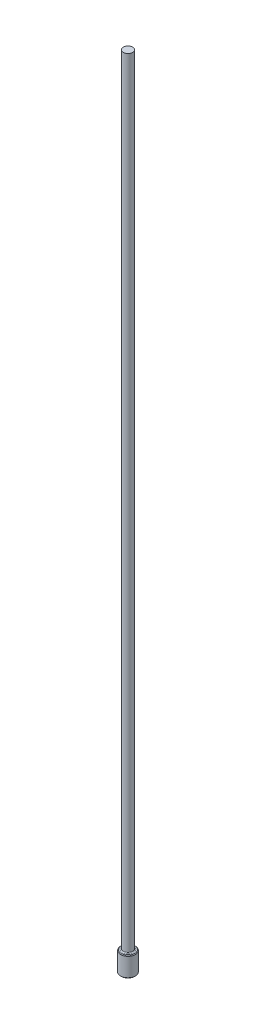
from build123d import *

# Parameters (mm, degrees)
CHAMFER1_SIZE = 0.0508
FILLET1_R     = 0.0762


with BuildPart() as part:
    # Sketch1 → Revolve1 (revolve)
    with BuildSketch(Plane.XY, mode=Mode.PRIVATE) as revolve1_sk:
        Polygon((0, 0), (-0.5842, 0), (-0.5842, 1.5748), (-0.3683, 1.5748), (-0.3683, 63.5), (0, 63.5), align=None)
    revolve(revolve1_sk.sketch.rotate(Axis((0, 259.958771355, 0), (0, -1, 0)), 270), axis=Axis((0, 259.958771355, 0), (0, -1, 0)))

    # Chamfer1
    chamfer1_edges = [part.edges().sort_by_distance(p)[0] for p in [
        (0, 1.5748, -0.5842),
        (0, 0, -0.5842),
    ]]
    chamfer(chamfer1_edges, length=CHAMFER1_SIZE)

    # Fillet1
    fillet1_edges = [part.edges().sort_by_distance(p)[0] for p in [
        (0, 1.5748, -0.3683),
    ]]
    fillet(fillet1_edges, radius=FILLET1_R)


solid = part.part
